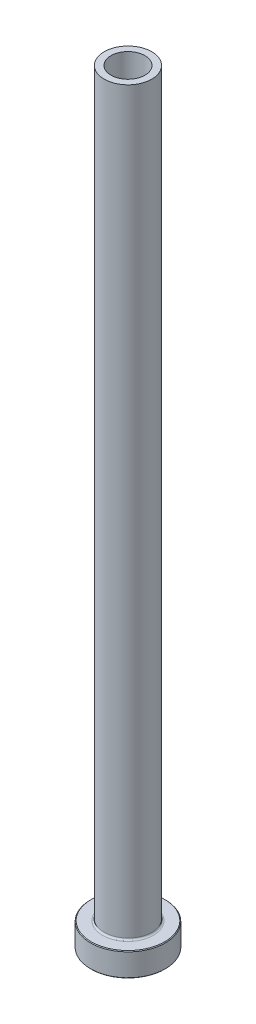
ISO-10303-21;
HEADER;
FILE_DESCRIPTION(('STEP AP214'),'2;1');
FILE_NAME('part.step','',(''),(''),'','','');
FILE_SCHEMA(('AUTOMOTIVE_DESIGN { 1 0 10303 214 1 1 1 1 }'));
ENDSEC;
DATA;
#1=APPLICATION_CONTEXT('core data for automotive mechanical design processes');
#2=APPLICATION_PROTOCOL_DEFINITION('international standard','automotive_design',2000,#1);
#3=PRODUCT_CONTEXT('',#1,'mechanical');
#4=PRODUCT('Part','Part','',(#3));
#5=PRODUCT_RELATED_PRODUCT_CATEGORY('part','',(#4));
#6=PRODUCT_DEFINITION_FORMATION('','',#4);
#7=PRODUCT_DEFINITION_CONTEXT('part definition',#1,'design');
#8=PRODUCT_DEFINITION('design','',#6,#7);
#9=PRODUCT_DEFINITION_SHAPE('','',#8);
#10=(LENGTH_UNIT() NAMED_UNIT(*) SI_UNIT(.MILLI.,.METRE.));
#11=(NAMED_UNIT(*) PLANE_ANGLE_UNIT() SI_UNIT($,.RADIAN.));
#12=(NAMED_UNIT(*) SI_UNIT($,.STERADIAN.) SOLID_ANGLE_UNIT());
#13=UNCERTAINTY_MEASURE_WITH_UNIT(LENGTH_MEASURE(1.E-05),#10,'distance_accuracy_value','');
#14=(GEOMETRIC_REPRESENTATION_CONTEXT(3) GLOBAL_UNCERTAINTY_ASSIGNED_CONTEXT((#13)) GLOBAL_UNIT_ASSIGNED_CONTEXT((#10,
#11,#12)) REPRESENTATION_CONTEXT('',''));
#15=CARTESIAN_POINT('',(0.,0.,0.));
#16=DIRECTION('',(0.,0.,1.));
#17=DIRECTION('',(1.,0.,0.));
#18=AXIS2_PLACEMENT_3D('',#15,#16,#17);
#19=CARTESIAN_POINT('',(0.,92.1876809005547,0.));
#20=DIRECTION('',(0.,1.,0.));
#21=DIRECTION('',(0.,0.,1.));
#22=AXIS2_PLACEMENT_3D('',#19,#20,#21);
#23=CYLINDRICAL_SURFACE('',#22,5.00000000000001);
#24=CARTESIAN_POINT('',(0.,225.,0.));
#25=DIRECTION('',(0.,1.,0.));
#26=DIRECTION('',(0.,0.,1.));
#27=AXIS2_PLACEMENT_3D('',#24,#25,#26);
#28=CIRCLE('',#27,5.00000000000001);
#29=CARTESIAN_POINT('',(0.,225.,5.00000000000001));
#30=VERTEX_POINT('',#29);
#31=EDGE_CURVE('E62',#30,#30,#28,.T.);
#32=ORIENTED_EDGE('',*,*,#31,.T.);
#33=EDGE_LOOP('',(#32));
#34=FACE_BOUND('',#33,.T.);
#35=CARTESIAN_POINT('',(0.,180.,0.));
#36=DIRECTION('',(0.,1.,0.));
#37=DIRECTION('',(0.,0.,1.));
#38=AXIS2_PLACEMENT_3D('',#35,#36,#37);
#39=CIRCLE('',#38,5.00000000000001);
#40=CARTESIAN_POINT('',(0.,180.,5.00000000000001));
#41=VERTEX_POINT('',#40);
#42=EDGE_CURVE('E71',#41,#41,#39,.T.);
#43=ORIENTED_EDGE('',*,*,#42,.F.);
#44=EDGE_LOOP('',(#43));
#45=FACE_BOUND('',#44,.T.);
#46=ADVANCED_FACE('F30',(#34,#45),#23,.F.);
#47=CARTESIAN_POINT('',(-5.00000000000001,225.,0.));
#48=DIRECTION('',(0.,1.,0.));
#49=DIRECTION('',(0.,0.,1.));
#50=AXIS2_PLACEMENT_3D('',#47,#48,#49);
#51=PLANE('',#50);
#52=CARTESIAN_POINT('',(0.,225.,0.));
#53=DIRECTION('',(0.,1.,0.));
#54=DIRECTION('',(0.,0.,1.));
#55=AXIS2_PLACEMENT_3D('',#52,#53,#54);
#56=CIRCLE('',#55,7.00000000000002);
#57=CARTESIAN_POINT('',(0.,225.,7.00000000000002));
#58=VERTEX_POINT('',#57);
#59=EDGE_CURVE('E65',#58,#58,#56,.T.);
#60=ORIENTED_EDGE('',*,*,#59,.T.);
#61=EDGE_LOOP('',(#60));
#62=FACE_BOUND('',#61,.T.);
#63=ORIENTED_EDGE('',*,*,#31,.F.);
#64=EDGE_LOOP('',(#63));
#65=FACE_BOUND('',#64,.T.);
#66=ADVANCED_FACE('F79',(#62,#65),#51,.T.);
#67=CARTESIAN_POINT('',(0.,92.1876809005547,0.));
#68=DIRECTION('',(0.,1.,0.));
#69=DIRECTION('',(0.,0.,1.));
#70=AXIS2_PLACEMENT_3D('',#67,#68,#69);
#71=CYLINDRICAL_SURFACE('',#70,7.);
#72=CARTESIAN_POINT('',(0.,7.50000000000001,0.));
#73=DIRECTION('',(0.,1.,0.));
#74=DIRECTION('',(0.,0.,1.));
#75=AXIS2_PLACEMENT_3D('',#72,#73,#74);
#76=CIRCLE('',#75,7.);
#77=CARTESIAN_POINT('',(0.,7.50000000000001,7.));
#78=VERTEX_POINT('',#77);
#79=EDGE_CURVE('E59',#78,#78,#76,.T.);
#80=ORIENTED_EDGE('',*,*,#79,.T.);
#81=EDGE_LOOP('',(#80));
#82=FACE_BOUND('',#81,.T.);
#83=ORIENTED_EDGE('',*,*,#59,.F.);
#84=EDGE_LOOP('',(#83));
#85=FACE_BOUND('',#84,.T.);
#86=ADVANCED_FACE('F85',(#82,#85),#71,.T.);
#87=CARTESIAN_POINT('',(-6.99999999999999,7.,0.));
#88=DIRECTION('',(0.,1.,0.));
#89=DIRECTION('',(0.,0.,1.));
#90=AXIS2_PLACEMENT_3D('',#87,#88,#89);
#91=PLANE('',#90);
#92=CARTESIAN_POINT('',(0.,7.,0.));
#93=DIRECTION('',(0.,1.,0.));
#94=DIRECTION('',(0.,0.,1.));
#95=AXIS2_PLACEMENT_3D('',#92,#93,#94);
#96=CIRCLE('',#95,10.8);
#97=CARTESIAN_POINT('',(0.,7.,10.8));
#98=VERTEX_POINT('',#97);
#99=EDGE_CURVE('E53',#98,#98,#96,.T.);
#100=ORIENTED_EDGE('',*,*,#99,.T.);
#101=EDGE_LOOP('',(#100));
#102=FACE_BOUND('',#101,.T.);
#103=CARTESIAN_POINT('',(0.,7.,0.));
#104=DIRECTION('',(0.,1.,0.));
#105=DIRECTION('',(0.,0.,1.));
#106=AXIS2_PLACEMENT_3D('',#103,#104,#105);
#107=CIRCLE('',#106,7.5);
#108=CARTESIAN_POINT('',(0.,7.,7.5));
#109=VERTEX_POINT('',#108);
#110=EDGE_CURVE('E56',#109,#109,#107,.F.);
#111=ORIENTED_EDGE('',*,*,#110,.T.);
#112=EDGE_LOOP('',(#111));
#113=FACE_BOUND('',#112,.T.);
#114=ADVANCED_FACE('F111',(#102,#113),#91,.T.);
#115=CARTESIAN_POINT('',(0.,92.1876809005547,0.));
#116=DIRECTION('',(0.,1.,0.));
#117=DIRECTION('',(0.,0.,1.));
#118=AXIS2_PLACEMENT_3D('',#115,#116,#117);
#119=CYLINDRICAL_SURFACE('',#118,11.);
#120=CARTESIAN_POINT('',(0.,6.79999999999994,0.));
#121=DIRECTION('',(0.,1.,0.));
#122=DIRECTION('',(0.,0.,1.));
#123=AXIS2_PLACEMENT_3D('',#120,#121,#122);
#124=CIRCLE('',#123,11.);
#125=CARTESIAN_POINT('',(0.,6.79999999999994,11.));
#126=VERTEX_POINT('',#125);
#127=EDGE_CURVE('E45',#126,#126,#124,.F.);
#128=ORIENTED_EDGE('',*,*,#127,.T.);
#129=EDGE_LOOP('',(#128));
#130=FACE_BOUND('',#129,.T.);
#131=CARTESIAN_POINT('',(0.,0.19999999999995,0.));
#132=DIRECTION('',(0.,-1.,0.));
#133=DIRECTION('',(0.,0.,-1.));
#134=AXIS2_PLACEMENT_3D('',#131,#132,#133);
#135=CIRCLE('',#134,11.);
#136=CARTESIAN_POINT('',(0.,0.19999999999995,11.));
#137=VERTEX_POINT('',#136);
#138=EDGE_CURVE('E50',#137,#137,#135,.F.);
#139=ORIENTED_EDGE('',*,*,#138,.T.);
#140=EDGE_LOOP('',(#139));
#141=FACE_BOUND('',#140,.T.);
#142=ADVANCED_FACE('F108',(#130,#141),#119,.T.);
#143=CARTESIAN_POINT('',(-11.,0.,0.));
#144=DIRECTION('',(0.,-1.,0.));
#145=DIRECTION('',(0.,0.,-1.));
#146=AXIS2_PLACEMENT_3D('',#143,#144,#145);
#147=PLANE('',#146);
#148=CARTESIAN_POINT('',(0.,0.,0.));
#149=DIRECTION('',(0.,-1.,0.));
#150=DIRECTION('',(0.,0.,-1.));
#151=AXIS2_PLACEMENT_3D('',#148,#149,#150);
#152=CIRCLE('',#151,5.75000000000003);
#153=CARTESIAN_POINT('',(0.,0.,-5.75000000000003));
#154=VERTEX_POINT('',#153);
#155=EDGE_CURVE('E37',#154,#154,#152,.F.);
#156=ORIENTED_EDGE('',*,*,#155,.T.);
#157=EDGE_LOOP('',(#156));
#158=FACE_BOUND('',#157,.T.);
#159=CARTESIAN_POINT('',(0.,0.,0.));
#160=DIRECTION('',(0.,-1.,0.));
#161=DIRECTION('',(0.,0.,-1.));
#162=AXIS2_PLACEMENT_3D('',#159,#160,#161);
#163=CIRCLE('',#162,10.8);
#164=CARTESIAN_POINT('',(0.,0.,10.8));
#165=VERTEX_POINT('',#164);
#166=EDGE_CURVE('E41',#165,#165,#163,.T.);
#167=ORIENTED_EDGE('',*,*,#166,.T.);
#168=EDGE_LOOP('',(#167));
#169=FACE_BOUND('',#168,.T.);
#170=ADVANCED_FACE('F110',(#158,#169),#147,.T.);
#171=CARTESIAN_POINT('',(0.,92.1876809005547,0.));
#172=DIRECTION('',(0.,1.,0.));
#173=DIRECTION('',(0.,0.,1.));
#174=AXIS2_PLACEMENT_3D('',#171,#172,#173);
#175=CYLINDRICAL_SURFACE('',#174,5.25);
#176=CARTESIAN_POINT('',(0.,0.500000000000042,0.));
#177=DIRECTION('',(0.,-1.,0.));
#178=DIRECTION('',(0.,0.,-1.));
#179=AXIS2_PLACEMENT_3D('',#176,#177,#178);
#180=CIRCLE('',#179,5.25);
#181=CARTESIAN_POINT('',(0.,0.500000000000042,-5.25));
#182=VERTEX_POINT('',#181);
#183=EDGE_CURVE('E10',#182,#182,#180,.T.);
#184=ORIENTED_EDGE('',*,*,#183,.T.);
#185=EDGE_LOOP('',(#184));
#186=FACE_BOUND('',#185,.T.);
#187=CARTESIAN_POINT('',(0.,168.,0.));
#188=DIRECTION('',(0.,1.,0.));
#189=DIRECTION('',(0.,0.,1.));
#190=AXIS2_PLACEMENT_3D('',#187,#188,#189);
#191=CIRCLE('',#190,5.25000000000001);
#192=CARTESIAN_POINT('',(0.,168.,5.25000000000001));
#193=VERTEX_POINT('',#192);
#194=EDGE_CURVE('E68',#193,#193,#191,.T.);
#195=ORIENTED_EDGE('',*,*,#194,.T.);
#196=EDGE_LOOP('',(#195));
#197=FACE_BOUND('',#196,.T.);
#198=ADVANCED_FACE('F118',(#186,#197),#175,.F.);
#199=CARTESIAN_POINT('',(0.,168.,0.));
#200=DIRECTION('',(0.,-1.,0.));
#201=DIRECTION('',(0.,0.,-1.));
#202=AXIS2_PLACEMENT_3D('',#199,#200,#201);
#203=CONICAL_SURFACE('',#202,5.25000000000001,0.0208303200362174);
#204=ORIENTED_EDGE('',*,*,#42,.T.);
#205=EDGE_LOOP('',(#204));
#206=FACE_BOUND('',#205,.T.);
#207=ORIENTED_EDGE('',*,*,#194,.F.);
#208=EDGE_LOOP('',(#207));
#209=FACE_BOUND('',#208,.T.);
#210=ADVANCED_FACE('F75',(#206,#209),#203,.F.);
#211=CARTESIAN_POINT('',(0.,7.50000000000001,0.));
#212=DIRECTION('',(0.,1.,0.));
#213=DIRECTION('',(0.,0.,1.));
#214=AXIS2_PLACEMENT_3D('',#211,#212,#213);
#215=TOROIDAL_SURFACE('',#214,7.5,0.5);
#216=ORIENTED_EDGE('',*,*,#110,.F.);
#217=EDGE_LOOP('',(#216));
#218=FACE_BOUND('',#217,.T.);
#219=ORIENTED_EDGE('',*,*,#79,.F.);
#220=EDGE_LOOP('',(#219));
#221=FACE_BOUND('',#220,.T.);
#222=ADVANCED_FACE('F90',(#218,#221),#215,.F.);
#223=CARTESIAN_POINT('',(0.,7.00000000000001,0.));
#224=DIRECTION('',(0.,-1.,0.));
#225=DIRECTION('',(0.,0.,-1.));
#226=AXIS2_PLACEMENT_3D('',#223,#224,#225);
#227=CONICAL_SURFACE('',#226,10.7999999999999,0.785398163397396);
#228=ORIENTED_EDGE('',*,*,#127,.F.);
#229=EDGE_LOOP('',(#228));
#230=FACE_BOUND('',#229,.T.);
#231=ORIENTED_EDGE('',*,*,#99,.F.);
#232=EDGE_LOOP('',(#231));
#233=FACE_BOUND('',#232,.T.);
#234=ADVANCED_FACE('F93',(#230,#233),#227,.T.);
#235=CARTESIAN_POINT('',(0.,0.19999999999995,0.));
#236=DIRECTION('',(0.,1.,0.));
#237=DIRECTION('',(0.,0.,1.));
#238=AXIS2_PLACEMENT_3D('',#235,#236,#237);
#239=CONICAL_SURFACE('',#238,11.,0.785398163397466);
#240=CARTESIAN_POINT('',(0.,0.,10.8));
#241=CARTESIAN_POINT('',(0.,0.00208333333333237,10.8020833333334));
#242=CARTESIAN_POINT('',(0.,0.00416666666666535,10.8041666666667));
#243=CARTESIAN_POINT('',(0.,0.0083333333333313,10.8083333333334));
#244=CARTESIAN_POINT('',(0.,0.0104166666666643,10.8104166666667));
#245=CARTESIAN_POINT('',(0.,0.0145833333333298,10.8145833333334));
#246=CARTESIAN_POINT('',(0.,0.0166666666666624,10.8166666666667));
#247=CARTESIAN_POINT('',(0.,0.020833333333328,10.8208333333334));
#248=CARTESIAN_POINT('',(0.,0.0229166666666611,10.8229166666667));
#249=CARTESIAN_POINT('',(0.,0.0270833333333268,10.8270833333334));
#250=CARTESIAN_POINT('',(0.,0.0291666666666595,10.8291666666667));
#251=CARTESIAN_POINT('',(0.,0.033333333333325,10.8333333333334));
#252=CARTESIAN_POINT('',(0.,0.0354166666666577,10.8354166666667));
#253=CARTESIAN_POINT('',(0.,0.0395833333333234,10.8395833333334));
#254=CARTESIAN_POINT('',(0.,0.0416666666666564,10.8416666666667));
#255=CARTESIAN_POINT('',(0.,0.0458333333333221,10.8458333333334));
#256=CARTESIAN_POINT('',(0.,0.0479166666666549,10.8479166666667));
#257=CARTESIAN_POINT('',(0.,0.0520833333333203,10.8520833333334));
#258=CARTESIAN_POINT('',(0.,0.054166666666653,10.8541666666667));
#259=CARTESIAN_POINT('',(0.,0.0583333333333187,10.8583333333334));
#260=CARTESIAN_POINT('',(0.,0.0604166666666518,10.8604166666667));
#261=CARTESIAN_POINT('',(0.,0.0645833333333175,10.8645833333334));
#262=CARTESIAN_POINT('',(0.,0.0666666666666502,10.8666666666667));
#263=CARTESIAN_POINT('',(0.,0.0708333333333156,10.8708333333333));
#264=CARTESIAN_POINT('',(0.,0.0729166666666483,10.8729166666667));
#265=CARTESIAN_POINT('',(0.,0.0770833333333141,10.8770833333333));
#266=CARTESIAN_POINT('',(0.,0.0791666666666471,10.8791666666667));
#267=CARTESIAN_POINT('',(0.,0.0833333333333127,10.8833333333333));
#268=CARTESIAN_POINT('',(0.,0.0854166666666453,10.8854166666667));
#269=CARTESIAN_POINT('',(0.,0.0895833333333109,10.8895833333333));
#270=CARTESIAN_POINT('',(0.,0.0916666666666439,10.8916666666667));
#271=CARTESIAN_POINT('',(0.,0.0958333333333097,10.8958333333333));
#272=CARTESIAN_POINT('',(0.,0.0979166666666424,10.8979166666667));
#273=CARTESIAN_POINT('',(0.,0.102083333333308,10.9020833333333));
#274=CARTESIAN_POINT('',(0.,0.104166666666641,10.9041666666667));
#275=CARTESIAN_POINT('',(0.,0.108333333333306,10.9083333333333));
#276=CARTESIAN_POINT('',(0.,0.110416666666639,10.9104166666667));
#277=CARTESIAN_POINT('',(0.,0.114583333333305,10.9145833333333));
#278=CARTESIAN_POINT('',(0.,0.116666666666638,10.9166666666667));
#279=CARTESIAN_POINT('',(0.,0.120833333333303,10.9208333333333));
#280=CARTESIAN_POINT('',(0.,0.122916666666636,10.9229166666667));
#281=CARTESIAN_POINT('',(0.,0.127083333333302,10.9270833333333));
#282=CARTESIAN_POINT('',(0.,0.129166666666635,10.9291666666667));
#283=CARTESIAN_POINT('',(0.,0.1333333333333,10.9333333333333));
#284=CARTESIAN_POINT('',(0.,0.135416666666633,10.9354166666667));
#285=CARTESIAN_POINT('',(0.,0.139583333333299,10.9395833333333));
#286=CARTESIAN_POINT('',(0.,0.141666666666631,10.9416666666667));
#287=CARTESIAN_POINT('',(0.,0.145833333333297,10.9458333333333));
#288=CARTESIAN_POINT('',(0.,0.14791666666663,10.9479166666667));
#289=CARTESIAN_POINT('',(0.,0.152083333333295,10.9520833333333));
#290=CARTESIAN_POINT('',(0.,0.154166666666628,10.9541666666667));
#291=CARTESIAN_POINT('',(0.,0.158333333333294,10.9583333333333));
#292=CARTESIAN_POINT('',(0.,0.160416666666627,10.9604166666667));
#293=CARTESIAN_POINT('',(0.,0.164583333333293,10.9645833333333));
#294=CARTESIAN_POINT('',(0.,0.166666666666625,10.9666666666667));
#295=CARTESIAN_POINT('',(0.,0.170833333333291,10.9708333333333));
#296=CARTESIAN_POINT('',(0.,0.172916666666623,10.9729166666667));
#297=CARTESIAN_POINT('',(0.,0.177083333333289,10.9770833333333));
#298=CARTESIAN_POINT('',(0.,0.179166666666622,10.9791666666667));
#299=CARTESIAN_POINT('',(0.,0.183333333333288,10.9833333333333));
#300=CARTESIAN_POINT('',(0.,0.18541666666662,10.9854166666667));
#301=CARTESIAN_POINT('',(0.,0.189583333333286,10.9895833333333));
#302=CARTESIAN_POINT('',(0.,0.191666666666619,10.9916666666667));
#303=CARTESIAN_POINT('',(0.,0.195833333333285,10.9958333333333));
#304=CARTESIAN_POINT('',(0.,0.197916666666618,10.9979166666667));
#305=CARTESIAN_POINT('',(0.,0.19999999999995,11.));
#306=B_SPLINE_CURVE_WITH_KNOTS('',3,(#240,#241,#242,#243,#244,#245,#246,#247,#248,#249,#250,
#251,#252,#253,#254,#255,#256,#257,#258,#259,#260,#261,#262,#263,#264,#265,#266,#267,#268,#269,
#270,#271,#272,#273,#274,#275,#276,#277,#278,#279,#280,#281,#282,#283,#284,#285,#286,#287,#288,
#289,#290,#291,#292,#293,#294,#295,#296,#297,#298,#299,#300,#301,#302,#303,#304,#305),
.UNSPECIFIED.,.F.,.F.,(4,2,2,2,2,2,2,2,2,2,2,2,2,2,2,2,2,2,2,2,2,2,2,2,2,2,2,2,2,2,2,2,4),(0.,
0.00883883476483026,0.0176776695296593,0.0265165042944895,0.0353553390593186,0.0441941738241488,
0.0530330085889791,0.0618718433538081,0.0707106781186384,0.0795495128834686,0.0883883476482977,
0.0972271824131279,0.106066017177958,0.114904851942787,0.123743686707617,0.132582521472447,
0.141421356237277,0.150260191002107,0.159099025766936,0.167937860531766,0.176776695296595,
0.185615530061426,0.194454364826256,0.203293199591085,0.212132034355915,0.220970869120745,
0.229809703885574,0.238648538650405,0.247487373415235,0.256326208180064,0.265165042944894,
0.274003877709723,0.282842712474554),.UNSPECIFIED.);
#307=EDGE_CURVE('BSEAM96',#165,#137,#306,.T.);
#308=ORIENTED_EDGE('',*,*,#166,.F.);
#309=ORIENTED_EDGE('',*,*,#138,.F.);
#310=ORIENTED_EDGE('',*,*,#307,.T.);
#311=ORIENTED_EDGE('',*,*,#307,.F.);
#312=EDGE_LOOP('',(#308,#310,#309,#311));
#313=FACE_BOUND('',#312,.T.);
#314=ADVANCED_FACE('F96',(#313),#239,.T.);
#315=CARTESIAN_POINT('',(0.,0.,0.));
#316=DIRECTION('',(0.,-1.,0.));
#317=DIRECTION('',(0.,0.,-1.));
#318=AXIS2_PLACEMENT_3D('',#315,#316,#317);
#319=CONICAL_SURFACE('',#318,5.75000000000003,0.785398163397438);
#320=ORIENTED_EDGE('',*,*,#183,.F.);
#321=EDGE_LOOP('',(#320));
#322=FACE_BOUND('',#321,.T.);
#323=ORIENTED_EDGE('',*,*,#155,.F.);
#324=EDGE_LOOP('',(#323));
#325=FACE_BOUND('',#324,.T.);
#326=ADVANCED_FACE('F32',(#322,#325),#319,.F.);
#327=CLOSED_SHELL('',(#46,#66,#86,#114,#142,#170,#198,#210,#222,#234,#314,#326));
#328=MANIFOLD_SOLID_BREP('B2',#327);
#329=ADVANCED_BREP_SHAPE_REPRESENTATION('',(#18,#328),#14);
#330=SHAPE_DEFINITION_REPRESENTATION(#9,#329);
ENDSEC;
END-ISO-10303-21;
